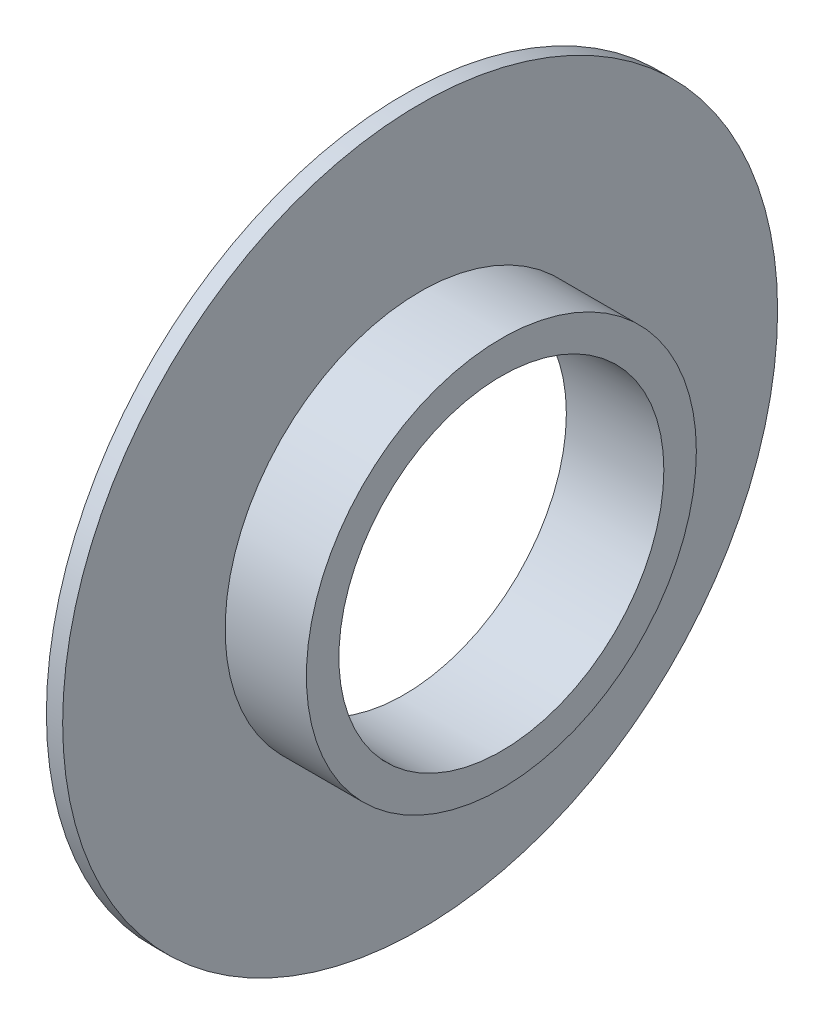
from build123d import *

# Parameters (mm, degrees)
ESQUISSE2_R             = 5
ENL_V_MAT_EXTRU_1_DEPTH = 16.842979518


with BuildPart() as part:
    # Esquisse1 → R_volution1 (revolve)
    with BuildSketch(Plane(origin=(0, 0, 0), x_dir=(1, 0, 0), z_dir=(0, 1, 0))):
        Polygon((0, 6), (-2.5, 6), (-2.5, 11), (-3, 11), (-3, 0), (0, 0), align=None)
    revolve(axis=Axis((0, 0, 0), (-1, 0, 0)))

    # Esquisse2 → Enl_v. mat.-Extru.1 (cut, through all)
    with BuildSketch(Plane(origin=(0, 0, 0), x_dir=(0, 0, -1), z_dir=(1, 0, 0))):
        Circle(ESQUISSE2_R)
    extrude(amount=-ENL_V_MAT_EXTRU_1_DEPTH, mode=Mode.SUBTRACT)


solid = part.part
